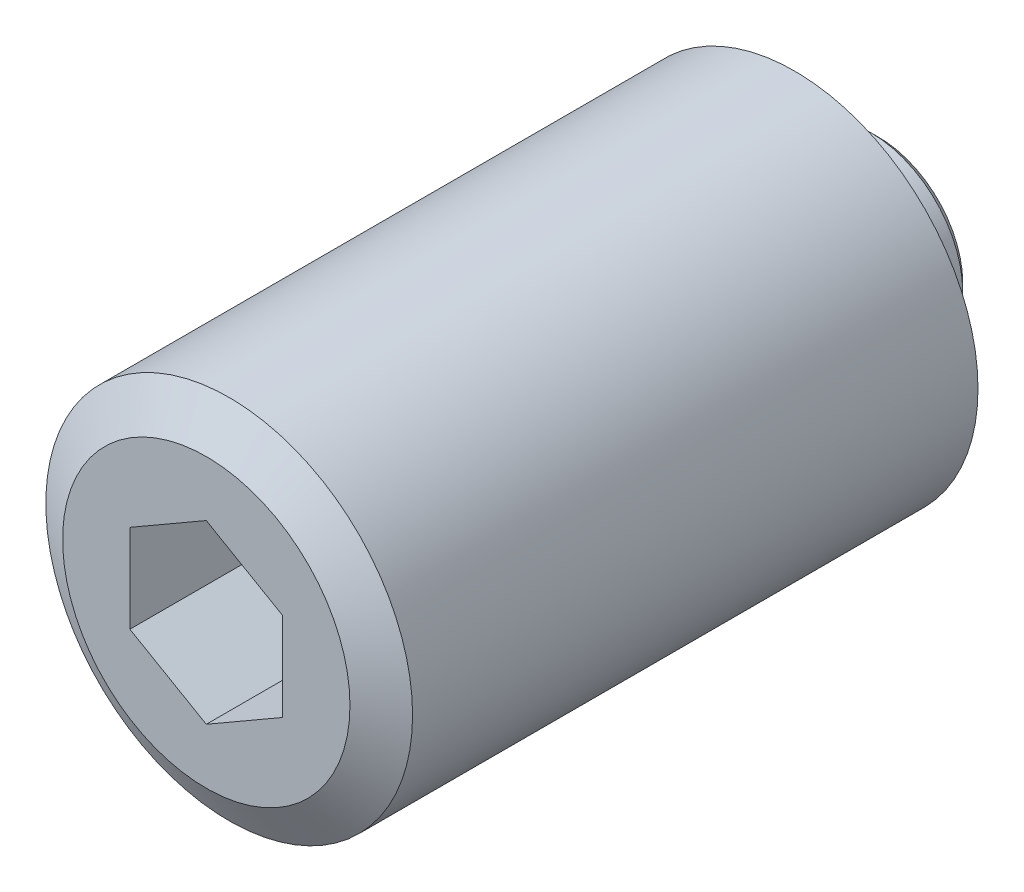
ISO-10303-21;
HEADER;
FILE_DESCRIPTION(('STEP AP214'),'2;1');
FILE_NAME('part.step','',(''),(''),'','','');
FILE_SCHEMA(('AUTOMOTIVE_DESIGN { 1 0 10303 214 1 1 1 1 }'));
ENDSEC;
DATA;
#1=APPLICATION_CONTEXT('core data for automotive mechanical design processes');
#2=APPLICATION_PROTOCOL_DEFINITION('international standard','automotive_design',2000,#1);
#3=PRODUCT_CONTEXT('',#1,'mechanical');
#4=PRODUCT('Part','Part','',(#3));
#5=PRODUCT_RELATED_PRODUCT_CATEGORY('part','',(#4));
#6=PRODUCT_DEFINITION_FORMATION('','',#4);
#7=PRODUCT_DEFINITION_CONTEXT('part definition',#1,'design');
#8=PRODUCT_DEFINITION('design','',#6,#7);
#9=PRODUCT_DEFINITION_SHAPE('','',#8);
#10=(LENGTH_UNIT() NAMED_UNIT(*) SI_UNIT(.MILLI.,.METRE.));
#11=(NAMED_UNIT(*) PLANE_ANGLE_UNIT() SI_UNIT($,.RADIAN.));
#12=(NAMED_UNIT(*) SI_UNIT($,.STERADIAN.) SOLID_ANGLE_UNIT());
#13=UNCERTAINTY_MEASURE_WITH_UNIT(LENGTH_MEASURE(1.E-05),#10,'distance_accuracy_value','');
#14=(GEOMETRIC_REPRESENTATION_CONTEXT(3) GLOBAL_UNCERTAINTY_ASSIGNED_CONTEXT((#13)) GLOBAL_UNIT_ASSIGNED_CONTEXT((#10,
#11,#12)) REPRESENTATION_CONTEXT('',''));
#15=CARTESIAN_POINT('',(0.,0.,0.));
#16=DIRECTION('',(0.,0.,1.));
#17=DIRECTION('',(1.,0.,0.));
#18=AXIS2_PLACEMENT_3D('',#15,#16,#17);
#19=CARTESIAN_POINT('',(0.,0.,0.));
#20=DIRECTION('',(0.,0.,1.));
#21=DIRECTION('',(1.,0.,0.));
#22=AXIS2_PLACEMENT_3D('',#19,#20,#21);
#23=PLANE('',#22);
#24=CARTESIAN_POINT('',(0.,0.,0.));
#25=DIRECTION('',(0.,0.,1.));
#26=DIRECTION('',(1.,0.,0.));
#27=AXIS2_PLACEMENT_3D('',#24,#25,#26);
#28=CIRCLE('',#27,5.5);
#29=CARTESIAN_POINT('',(5.5,0.,0.));
#30=VERTEX_POINT('',#29);
#31=EDGE_CURVE('E9',#30,#30,#28,.T.);
#32=ORIENTED_EDGE('',*,*,#31,.F.);
#33=EDGE_LOOP('',(#32));
#34=FACE_BOUND('',#33,.T.);
#35=ADVANCED_FACE('F14',(#34),#23,.F.);
#36=CARTESIAN_POINT('',(0.,0.,0.));
#37=DIRECTION('',(0.,0.,1.));
#38=DIRECTION('',(1.,0.,0.));
#39=AXIS2_PLACEMENT_3D('',#36,#37,#38);
#40=CONICAL_SURFACE('',#39,5.5,0.785398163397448);
#41=CARTESIAN_POINT('',(0.,0.,0.5));
#42=DIRECTION('',(0.,0.,1.));
#43=DIRECTION('',(1.,0.,0.));
#44=AXIS2_PLACEMENT_3D('',#41,#42,#43);
#45=CIRCLE('',#44,6.);
#46=CARTESIAN_POINT('',(6.,0.,0.5));
#47=VERTEX_POINT('',#46);
#48=EDGE_CURVE('E21',#47,#47,#45,.T.);
#49=ORIENTED_EDGE('',*,*,#48,.F.);
#50=EDGE_LOOP('',(#49));
#51=FACE_BOUND('',#50,.T.);
#52=ORIENTED_EDGE('',*,*,#31,.T.);
#53=EDGE_LOOP('',(#52));
#54=FACE_BOUND('',#53,.T.);
#55=ADVANCED_FACE('F145',(#51,#54),#40,.T.);
#56=CARTESIAN_POINT('',(0.,0.,48.0000000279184));
#57=DIRECTION('',(0.,0.,1.));
#58=DIRECTION('',(1.,0.,0.));
#59=AXIS2_PLACEMENT_3D('',#56,#57,#58);
#60=CYLINDRICAL_SURFACE('',#59,6.);
#61=CARTESIAN_POINT('',(0.,0.,2.6));
#62=DIRECTION('',(0.,0.,1.));
#63=DIRECTION('',(1.,0.,0.));
#64=AXIS2_PLACEMENT_3D('',#61,#62,#63);
#65=CIRCLE('',#64,6.);
#66=CARTESIAN_POINT('',(6.,0.,2.6));
#67=VERTEX_POINT('',#66);
#68=EDGE_CURVE('E138',#67,#67,#65,.T.);
#69=ORIENTED_EDGE('',*,*,#68,.F.);
#70=EDGE_LOOP('',(#69));
#71=FACE_BOUND('',#70,.T.);
#72=ORIENTED_EDGE('',*,*,#48,.T.);
#73=EDGE_LOOP('',(#72));
#74=FACE_BOUND('',#73,.T.);
#75=ADVANCED_FACE('F143',(#71,#74),#60,.T.);
#76=CARTESIAN_POINT('',(0.,6.21369453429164,2.6));
#77=DIRECTION('',(0.,0.,1.));
#78=DIRECTION('',(1.,0.,0.));
#79=AXIS2_PLACEMENT_3D('',#76,#77,#78);
#80=PLANE('',#79);
#81=CARTESIAN_POINT('',(0.,0.,2.6));
#82=DIRECTION('',(0.,0.,1.));
#83=DIRECTION('',(1.,0.,0.));
#84=AXIS2_PLACEMENT_3D('',#81,#82,#83);
#85=CIRCLE('',#84,6.21369453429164);
#86=CARTESIAN_POINT('',(0.,6.21369453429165,2.6));
#87=VERTEX_POINT('',#86);
#88=EDGE_CURVE('E135',#87,#87,#85,.T.);
#89=ORIENTED_EDGE('',*,*,#88,.F.);
#90=EDGE_LOOP('',(#89));
#91=FACE_BOUND('',#90,.T.);
#92=ORIENTED_EDGE('',*,*,#68,.T.);
#93=EDGE_LOOP('',(#92));
#94=FACE_BOUND('',#93,.T.);
#95=ADVANCED_FACE('F170',(#91,#94),#80,.F.);
#96=CARTESIAN_POINT('',(0.,-1.53354676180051E-07,6.79999989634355));
#97=DIRECTION('',(0.,0.,1.));
#98=DIRECTION('',(0.,1.,0.));
#99=AXIS2_PLACEMENT_3D('',#96,#97,#98);
#100=SPHERICAL_SURFACE('',#99,7.50000005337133);
#101=CARTESIAN_POINT('',(0.,0.,3.99999988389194));
#102=DIRECTION('',(0.,0.,1.));
#103=DIRECTION('',(1.,0.,0.));
#104=AXIS2_PLACEMENT_3D('',#101,#102,#103);
#105=CIRCLE('',#104,6.95772941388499);
#106=CARTESIAN_POINT('',(0.,6.95772941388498,3.99999988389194));
#107=VERTEX_POINT('',#106);
#108=EDGE_CURVE('E132',#107,#107,#105,.T.);
#109=CARTESIAN_POINT('',(0.,6.95772941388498,3.99999988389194));
#110=CARTESIAN_POINT('',(0.,6.95155231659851,3.98465039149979));
#111=CARTESIAN_POINT('',(0.,6.94532442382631,3.9693213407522));
#112=CARTESIAN_POINT('',(0.,6.93276732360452,3.93870479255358));
#113=CARTESIAN_POINT('',(0.,6.92643811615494,3.92341729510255));
#114=CARTESIAN_POINT('',(0.,6.91367866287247,3.89288452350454));
#115=CARTESIAN_POINT('',(0.,6.90724841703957,3.87763924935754));
#116=CARTESIAN_POINT('',(0.,6.89428716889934,3.8471915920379));
#117=CARTESIAN_POINT('',(0.,6.88775616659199,3.83198920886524));
#118=CARTESIAN_POINT('',(0.,6.87459369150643,3.80162799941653));
#119=CARTESIAN_POINT('',(0.,6.86796221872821,3.78646917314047));
#120=CARTESIAN_POINT('',(0.,6.85459909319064,3.75619574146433));
#121=CARTESIAN_POINT('',(0.,6.84786744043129,3.74108113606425));
#122=CARTESIAN_POINT('',(0.,6.83430424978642,3.71089680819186));
#123=CARTESIAN_POINT('',(0.,6.82747271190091,3.69582708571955));
#124=CARTESIAN_POINT('',(0.,6.81371005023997,3.66573318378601));
#125=CARTESIAN_POINT('',(0.,6.80677892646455,3.65070900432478));
#126=CARTESIAN_POINT('',(0.,6.79281739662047,3.62070684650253));
#127=CARTESIAN_POINT('',(0.,6.78578699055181,3.60572886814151));
#128=CARTESIAN_POINT('',(0.,6.77162720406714,3.57581976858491));
#129=CARTESIAN_POINT('',(0.,6.76449782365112,3.56088864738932));
#130=CARTESIAN_POINT('',(0.,6.75014040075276,3.53107391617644));
#131=CARTESIAN_POINT('',(0.,6.74291235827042,3.51619030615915));
#132=CARTESIAN_POINT('',(0.,6.72835792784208,3.4864712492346));
#133=CARTESIAN_POINT('',(0.,6.72103153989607,3.47163580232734));
#134=CARTESIAN_POINT('',(0.,6.70628073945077,3.44201372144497));
#135=CARTESIAN_POINT('',(0.,6.69885632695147,3.42722708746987));
#136=CARTESIAN_POINT('',(0.,6.68390980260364,3.39770328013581));
#137=CARTESIAN_POINT('',(0.,6.67638769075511,3.38296610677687));
#138=CARTESIAN_POINT('',(0.,6.66124609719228,3.35354186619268));
#139=CARTESIAN_POINT('',(0.,6.65362661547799,3.33885479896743));
#140=CARTESIAN_POINT('',(0.,6.6382906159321,3.30953141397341));
#141=CARTESIAN_POINT('',(0.,6.63057409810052,3.29489509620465));
#142=CARTESIAN_POINT('',(0.,6.6150443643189,3.26567385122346));
#143=CARTESIAN_POINT('',(0.,6.60723114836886,3.25108892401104));
#144=CARTESIAN_POINT('',(0.,6.59150836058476,3.2219710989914));
#145=CARTESIAN_POINT('',(0.,6.5835987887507,3.20743820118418));
#146=CARTESIAN_POINT('',(0.,6.56768363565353,3.17842507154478));
#147=CARTESIAN_POINT('',(0.,6.55967805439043,3.16394483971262));
#148=CARTESIAN_POINT('',(0.,6.54357123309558,3.13503767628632));
#149=CARTESIAN_POINT('',(0.,6.53546999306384,3.1206107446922));
#150=CARTESIAN_POINT('',(0.,6.51917220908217,3.09181081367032));
#151=CARTESIAN_POINT('',(0.,6.51097566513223,3.07743781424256));
#152=CARTESIAN_POINT('',(0.,6.49448763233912,3.04874637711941));
#153=CARTESIAN_POINT('',(0.,6.48619614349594,3.03442793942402));
#154=CARTESIAN_POINT('',(0.,6.46951858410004,3.00584625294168));
#155=CARTESIAN_POINT('',(0.,6.46113251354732,2.99158300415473));
#156=CARTESIAN_POINT('',(0.,6.44426615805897,2.96311232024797));
#157=CARTESIAN_POINT('',(0.,6.43578587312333,2.94890488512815));
#158=CARTESIAN_POINT('',(0.,6.41873146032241,2.92054645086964));
#159=CARTESIAN_POINT('',(0.,6.41015733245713,2.90639545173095));
#160=CARTESIAN_POINT('',(0.,6.39291560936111,2.87815050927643));
#161=CARTESIAN_POINT('',(0.,6.38424801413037,2.86405656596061));
#162=CARTESIAN_POINT('',(0.,6.3668197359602,2.83592635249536));
#163=CARTESIAN_POINT('',(0.,6.35805905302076,2.82189008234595));
#164=CARTESIAN_POINT('',(0.,6.34044498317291,2.79387583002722));
#165=CARTESIAN_POINT('',(0.,6.33159159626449,2.7798978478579));
#166=CARTESIAN_POINT('',(0.,6.3137925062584,2.75200078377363));
#167=CARTESIAN_POINT('',(0.,6.30484680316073,2.73808170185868));
#168=CARTESIAN_POINT('',(0.,6.28686347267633,2.71030304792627));
#169=CARTESIAN_POINT('',(0.,6.27782584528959,2.69644347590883));
#170=CARTESIAN_POINT('',(0.,6.25965906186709,2.6687844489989));
#171=CARTESIAN_POINT('',(0.,6.25052990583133,2.65498499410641));
#172=CARTESIAN_POINT('',(0.,6.23218046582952,2.62744680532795));
#173=CARTESIAN_POINT('',(0.,6.22296018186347,2.61370807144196));
#174=CARTESIAN_POINT('',(0.,6.21369453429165,2.6));
#175=B_SPLINE_CURVE_WITH_KNOTS('',3,(#109,#110,#111,#112,#113,#114,#115,#116,#117,#118,#119,
#120,#121,#122,#123,#124,#125,#126,#127,#128,#129,#130,#131,#132,#133,#134,#135,#136,#137,#138,
#139,#140,#141,#142,#143,#144,#145,#146,#147,#148,#149,#150,#151,#152,#153,#154,#155,#156,#157,
#158,#159,#160,#161,#162,#163,#164,#165,#166,#167,#168,#169,#170,#171,#172,#173,#174),
.UNSPECIFIED.,.F.,.F.,(4,2,2,2,2,2,2,2,2,2,2,2,2,2,2,2,2,2,2,2,2,2,2,2,2,2,2,2,2,2,2,2,4),(0.,
0.049637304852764,0.0992746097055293,0.148911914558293,0.198549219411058,0.248186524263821,
0.297823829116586,0.34746113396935,0.397098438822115,0.446735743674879,0.496373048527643,
0.546010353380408,0.595647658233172,0.645284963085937,0.6949222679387,0.744559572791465,
0.794196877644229,0.843834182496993,0.893471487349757,0.943108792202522,0.992746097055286,
1.04238340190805,1.09202070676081,1.14165801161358,1.19129531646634,1.24093262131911,
1.29056992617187,1.34020723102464,1.3898445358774,1.43948184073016,1.48911914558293,
1.53875645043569,1.58839375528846),.UNSPECIFIED.);
#176=EDGE_CURVE('BSEAM179',#107,#87,#175,.T.);
#177=ORIENTED_EDGE('',*,*,#108,.F.);
#178=ORIENTED_EDGE('',*,*,#88,.T.);
#179=ORIENTED_EDGE('',*,*,#176,.T.);
#180=ORIENTED_EDGE('',*,*,#176,.F.);
#181=EDGE_LOOP('',(#177,#179,#178,#180));
#182=FACE_BOUND('',#181,.T.);
#183=ADVANCED_FACE('F179',(#182),#100,.T.);
#184=CARTESIAN_POINT('',(0.,9.401924,3.99999995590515));
#185=DIRECTION('',(0.,0.,1.));
#186=DIRECTION('',(1.,0.,0.));
#187=AXIS2_PLACEMENT_3D('',#184,#185,#186);
#188=PLANE('',#187);
#189=CARTESIAN_POINT('',(0.,0.,4.00000002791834));
#190=DIRECTION('',(0.,0.,1.));
#191=DIRECTION('',(1.,0.,0.));
#192=AXIS2_PLACEMENT_3D('',#189,#190,#191);
#193=CIRCLE('',#192,9.401924);
#194=CARTESIAN_POINT('',(9.401924,0.,4.00000002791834));
#195=VERTEX_POINT('',#194);
#196=EDGE_CURVE('E129',#195,#195,#193,.T.);
#197=ORIENTED_EDGE('',*,*,#196,.F.);
#198=EDGE_LOOP('',(#197));
#199=FACE_BOUND('',#198,.T.);
#200=ORIENTED_EDGE('',*,*,#108,.T.);
#201=EDGE_LOOP('',(#200));
#202=FACE_BOUND('',#201,.T.);
#203=ADVANCED_FACE('F188',(#199,#202),#188,.F.);
#204=CARTESIAN_POINT('',(0.,0.,4.00000002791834));
#205=DIRECTION('',(0.,0.,1.));
#206=DIRECTION('',(1.,0.,0.));
#207=AXIS2_PLACEMENT_3D('',#204,#205,#206);
#208=CONICAL_SURFACE('',#207,9.401924,1.04719751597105);
#209=CARTESIAN_POINT('',(0.,0.,5.50000002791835));
#210=DIRECTION('',(0.,0.,1.));
#211=DIRECTION('',(1.,0.,0.));
#212=AXIS2_PLACEMENT_3D('',#209,#210,#211);
#213=CIRCLE('',#212,12.);
#214=CARTESIAN_POINT('',(12.,0.,5.50000002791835));
#215=VERTEX_POINT('',#214);
#216=EDGE_CURVE('E126',#215,#215,#213,.T.);
#217=ORIENTED_EDGE('',*,*,#216,.F.);
#218=EDGE_LOOP('',(#217));
#219=FACE_BOUND('',#218,.T.);
#220=ORIENTED_EDGE('',*,*,#196,.T.);
#221=EDGE_LOOP('',(#220));
#222=FACE_BOUND('',#221,.T.);
#223=ADVANCED_FACE('F197',(#219,#222),#208,.T.);
#224=CARTESIAN_POINT('',(0.,0.,48.0000000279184));
#225=DIRECTION('',(0.,0.,1.));
#226=DIRECTION('',(1.,0.,0.));
#227=AXIS2_PLACEMENT_3D('',#224,#225,#226);
#228=CYLINDRICAL_SURFACE('',#227,12.);
#229=CARTESIAN_POINT('',(0.,0.,42.5000000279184));
#230=DIRECTION('',(0.,0.,1.));
#231=DIRECTION('',(1.,0.,0.));
#232=AXIS2_PLACEMENT_3D('',#229,#230,#231);
#233=CIRCLE('',#232,12.);
#234=CARTESIAN_POINT('',(12.,0.,42.5000000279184));
#235=VERTEX_POINT('',#234);
#236=EDGE_CURVE('E123',#235,#235,#233,.T.);
#237=ORIENTED_EDGE('',*,*,#236,.F.);
#238=EDGE_LOOP('',(#237));
#239=FACE_BOUND('',#238,.T.);
#240=ORIENTED_EDGE('',*,*,#216,.T.);
#241=EDGE_LOOP('',(#240));
#242=FACE_BOUND('',#241,.T.);
#243=ADVANCED_FACE('F206',(#239,#242),#228,.T.);
#244=CARTESIAN_POINT('',(0.,0.,42.5000000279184));
#245=DIRECTION('',(0.,0.,-1.));
#246=DIRECTION('',(-1.,0.,0.));
#247=AXIS2_PLACEMENT_3D('',#244,#245,#246);
#248=CONICAL_SURFACE('',#247,12.,1.04719751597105);
#249=CARTESIAN_POINT('',(0.,0.,44.0000000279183));
#250=DIRECTION('',(0.,0.,1.));
#251=DIRECTION('',(1.,0.,0.));
#252=AXIS2_PLACEMENT_3D('',#249,#250,#251);
#253=CIRCLE('',#252,9.401924);
#254=CARTESIAN_POINT('',(9.401924,0.,44.0000000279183));
#255=VERTEX_POINT('',#254);
#256=EDGE_CURVE('E115',#255,#255,#253,.T.);
#257=ORIENTED_EDGE('',*,*,#256,.F.);
#258=EDGE_LOOP('',(#257));
#259=FACE_BOUND('',#258,.T.);
#260=ORIENTED_EDGE('',*,*,#236,.T.);
#261=EDGE_LOOP('',(#260));
#262=FACE_BOUND('',#261,.T.);
#263=ADVANCED_FACE('F215',(#259,#262),#248,.T.);
#264=CARTESIAN_POINT('',(0.,9.401924,44.0000000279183));
#265=DIRECTION('',(0.,0.,-1.));
#266=DIRECTION('',(-1.,0.,0.));
#267=AXIS2_PLACEMENT_3D('',#264,#265,#266);
#268=PLANE('',#267);
#269=DIRECTION('',(-0.866025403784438,-0.5,0.));
#270=VECTOR('',#269,1.);
#271=CARTESIAN_POINT('',(0.,5.77350269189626,44.0000000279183));
#272=LINE('',#271,#270);
#273=CARTESIAN_POINT('',(0.,5.77350269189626,44.0000000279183));
#274=VERTEX_POINT('',#273);
#275=CARTESIAN_POINT('',(-5.,2.88675134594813,44.0000000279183));
#276=VERTEX_POINT('',#275);
#277=EDGE_CURVE('E102',#274,#276,#272,.T.);
#278=ORIENTED_EDGE('',*,*,#277,.F.);
#279=DIRECTION('',(-0.866025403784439,0.5,0.));
#280=VECTOR('',#279,1.);
#281=CARTESIAN_POINT('',(5.,2.88675134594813,44.0000000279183));
#282=LINE('',#281,#280);
#283=CARTESIAN_POINT('',(5.,2.88675134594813,44.0000000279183));
#284=VERTEX_POINT('',#283);
#285=EDGE_CURVE('E28',#284,#274,#282,.T.);
#286=ORIENTED_EDGE('',*,*,#285,.F.);
#287=DIRECTION('',(0.,1.,0.));
#288=VECTOR('',#287,1.);
#289=CARTESIAN_POINT('',(5.,-2.88675134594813,44.0000000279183));
#290=LINE('',#289,#288);
#291=CARTESIAN_POINT('',(5.,-2.88675134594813,44.0000000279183));
#292=VERTEX_POINT('',#291);
#293=EDGE_CURVE('E111',#292,#284,#290,.T.);
#294=ORIENTED_EDGE('',*,*,#293,.F.);
#295=DIRECTION('',(0.866025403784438,0.5,0.));
#296=VECTOR('',#295,1.);
#297=CARTESIAN_POINT('',(0.,-5.77350269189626,44.0000000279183));
#298=LINE('',#297,#296);
#299=CARTESIAN_POINT('',(0.,-5.77350269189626,44.0000000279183));
#300=VERTEX_POINT('',#299);
#301=EDGE_CURVE('E109',#300,#292,#298,.T.);
#302=ORIENTED_EDGE('',*,*,#301,.F.);
#303=DIRECTION('',(0.866025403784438,-0.5,0.));
#304=VECTOR('',#303,1.);
#305=CARTESIAN_POINT('',(-5.,-2.88675134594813,44.0000000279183));
#306=LINE('',#305,#304);
#307=CARTESIAN_POINT('',(-5.,-2.88675134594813,44.0000000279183));
#308=VERTEX_POINT('',#307);
#309=EDGE_CURVE('E76',#308,#300,#306,.T.);
#310=ORIENTED_EDGE('',*,*,#309,.F.);
#311=DIRECTION('',(0.,-1.,0.));
#312=VECTOR('',#311,1.);
#313=CARTESIAN_POINT('',(-5.,2.88675134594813,44.0000000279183));
#314=LINE('',#313,#312);
#315=EDGE_CURVE('E105',#276,#308,#314,.T.);
#316=ORIENTED_EDGE('',*,*,#315,.F.);
#317=EDGE_LOOP('',(#278,#286,#294,#302,#310,#316));
#318=FACE_BOUND('',#317,.T.);
#319=ORIENTED_EDGE('',*,*,#256,.T.);
#320=EDGE_LOOP('',(#319));
#321=FACE_BOUND('',#320,.T.);
#322=ADVANCED_FACE('F224',(#318,#321),#268,.F.);
#323=CARTESIAN_POINT('',(5.,2.88675134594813,36.0000000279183));
#324=DIRECTION('',(0.5,0.866025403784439,0.));
#325=DIRECTION('',(-0.866025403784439,0.5,0.));
#326=AXIS2_PLACEMENT_3D('',#323,#324,#325);
#327=PLANE('',#326);
#328=ORIENTED_EDGE('',*,*,#285,.T.);
#329=DIRECTION('',(0.,0.,1.));
#330=VECTOR('',#329,1.);
#331=CARTESIAN_POINT('',(0.,5.77350269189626,36.0000000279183));
#332=LINE('',#331,#330);
#333=CARTESIAN_POINT('',(0.,5.77350269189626,36.0000000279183));
#334=VERTEX_POINT('',#333);
#335=EDGE_CURVE('E58',#334,#274,#332,.T.);
#336=ORIENTED_EDGE('',*,*,#335,.F.);
#337=DIRECTION('',(-0.866025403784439,0.5,0.));
#338=VECTOR('',#337,1.);
#339=CARTESIAN_POINT('',(5.,2.88675134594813,36.0000000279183));
#340=LINE('',#339,#338);
#341=CARTESIAN_POINT('',(5.,2.88675134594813,36.0000000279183));
#342=VERTEX_POINT('',#341);
#343=EDGE_CURVE('E113',#342,#334,#340,.T.);
#344=ORIENTED_EDGE('',*,*,#343,.F.);
#345=DIRECTION('',(0.,0.,1.));
#346=VECTOR('',#345,1.);
#347=CARTESIAN_POINT('',(5.,2.88675134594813,36.0000000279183));
#348=LINE('',#347,#346);
#349=EDGE_CURVE('E36',#342,#284,#348,.T.);
#350=ORIENTED_EDGE('',*,*,#349,.T.);
#351=EDGE_LOOP('',(#328,#336,#344,#350));
#352=FACE_BOUND('',#351,.T.);
#353=ADVANCED_FACE('F233',(#352),#327,.F.);
#354=CARTESIAN_POINT('',(5.,-2.88675134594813,36.0000000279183));
#355=DIRECTION('',(1.,0.,0.));
#356=DIRECTION('',(0.,0.,-1.));
#357=AXIS2_PLACEMENT_3D('',#354,#355,#356);
#358=PLANE('',#357);
#359=ORIENTED_EDGE('',*,*,#293,.T.);
#360=ORIENTED_EDGE('',*,*,#349,.F.);
#361=DIRECTION('',(0.,1.,0.));
#362=VECTOR('',#361,1.);
#363=CARTESIAN_POINT('',(5.,-2.88675134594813,36.0000000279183));
#364=LINE('',#363,#362);
#365=CARTESIAN_POINT('',(5.,-2.88675134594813,36.0000000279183));
#366=VERTEX_POINT('',#365);
#367=EDGE_CURVE('E88',#366,#342,#364,.T.);
#368=ORIENTED_EDGE('',*,*,#367,.F.);
#369=DIRECTION('',(0.,0.,1.));
#370=VECTOR('',#369,1.);
#371=CARTESIAN_POINT('',(5.,-2.88675134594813,36.0000000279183));
#372=LINE('',#371,#370);
#373=EDGE_CURVE('E80',#366,#292,#372,.T.);
#374=ORIENTED_EDGE('',*,*,#373,.T.);
#375=EDGE_LOOP('',(#359,#360,#368,#374));
#376=FACE_BOUND('',#375,.T.);
#377=ADVANCED_FACE('F242',(#376),#358,.F.);
#378=CARTESIAN_POINT('',(0.,-5.77350269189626,36.0000000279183));
#379=DIRECTION('',(0.5,-0.866025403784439,0.));
#380=DIRECTION('',(0.866025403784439,0.5,0.));
#381=AXIS2_PLACEMENT_3D('',#378,#379,#380);
#382=PLANE('',#381);
#383=ORIENTED_EDGE('',*,*,#301,.T.);
#384=ORIENTED_EDGE('',*,*,#373,.F.);
#385=DIRECTION('',(0.866025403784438,0.5,0.));
#386=VECTOR('',#385,1.);
#387=CARTESIAN_POINT('',(0.,-5.77350269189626,36.0000000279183));
#388=LINE('',#387,#386);
#389=CARTESIAN_POINT('',(0.,-5.77350269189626,36.0000000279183));
#390=VERTEX_POINT('',#389);
#391=EDGE_CURVE('E84',#390,#366,#388,.T.);
#392=ORIENTED_EDGE('',*,*,#391,.F.);
#393=DIRECTION('',(0.,0.,1.));
#394=VECTOR('',#393,1.);
#395=CARTESIAN_POINT('',(0.,-5.77350269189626,36.0000000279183));
#396=LINE('',#395,#394);
#397=EDGE_CURVE('E69',#390,#300,#396,.T.);
#398=ORIENTED_EDGE('',*,*,#397,.T.);
#399=EDGE_LOOP('',(#383,#384,#392,#398));
#400=FACE_BOUND('',#399,.T.);
#401=ADVANCED_FACE('F85',(#400),#382,.F.);
#402=CARTESIAN_POINT('',(-5.,-2.88675134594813,36.0000000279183));
#403=DIRECTION('',(-0.5,-0.866025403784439,0.));
#404=DIRECTION('',(0.866025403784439,-0.5,0.));
#405=AXIS2_PLACEMENT_3D('',#402,#403,#404);
#406=PLANE('',#405);
#407=ORIENTED_EDGE('',*,*,#309,.T.);
#408=ORIENTED_EDGE('',*,*,#397,.F.);
#409=DIRECTION('',(0.866025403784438,-0.5,0.));
#410=VECTOR('',#409,1.);
#411=CARTESIAN_POINT('',(-5.,-2.88675134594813,36.0000000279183));
#412=LINE('',#411,#410);
#413=CARTESIAN_POINT('',(-5.,-2.88675134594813,36.0000000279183));
#414=VERTEX_POINT('',#413);
#415=EDGE_CURVE('E73',#414,#390,#412,.T.);
#416=ORIENTED_EDGE('',*,*,#415,.F.);
#417=DIRECTION('',(0.,0.,1.));
#418=VECTOR('',#417,1.);
#419=CARTESIAN_POINT('',(-5.,-2.88675134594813,36.0000000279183));
#420=LINE('',#419,#418);
#421=EDGE_CURVE('E81',#414,#308,#420,.T.);
#422=ORIENTED_EDGE('',*,*,#421,.T.);
#423=EDGE_LOOP('',(#407,#408,#416,#422));
#424=FACE_BOUND('',#423,.T.);
#425=ADVANCED_FACE('F71',(#424),#406,.F.);
#426=CARTESIAN_POINT('',(-5.,2.88675134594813,36.0000000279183));
#427=DIRECTION('',(-1.,0.,0.));
#428=DIRECTION('',(0.,0.,1.));
#429=AXIS2_PLACEMENT_3D('',#426,#427,#428);
#430=PLANE('',#429);
#431=ORIENTED_EDGE('',*,*,#315,.T.);
#432=ORIENTED_EDGE('',*,*,#421,.F.);
#433=DIRECTION('',(0.,-1.,0.));
#434=VECTOR('',#433,1.);
#435=CARTESIAN_POINT('',(-5.,2.88675134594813,36.0000000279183));
#436=LINE('',#435,#434);
#437=CARTESIAN_POINT('',(-5.,2.88675134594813,36.0000000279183));
#438=VERTEX_POINT('',#437);
#439=EDGE_CURVE('E94',#438,#414,#436,.T.);
#440=ORIENTED_EDGE('',*,*,#439,.F.);
#441=DIRECTION('',(0.,0.,1.));
#442=VECTOR('',#441,1.);
#443=CARTESIAN_POINT('',(-5.,2.88675134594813,36.0000000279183));
#444=LINE('',#443,#442);
#445=EDGE_CURVE('E118',#438,#276,#444,.T.);
#446=ORIENTED_EDGE('',*,*,#445,.T.);
#447=EDGE_LOOP('',(#431,#432,#440,#446));
#448=FACE_BOUND('',#447,.T.);
#449=ADVANCED_FACE('F264',(#448),#430,.F.);
#450=CARTESIAN_POINT('',(0.,5.77350269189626,36.0000000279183));
#451=DIRECTION('',(-0.5,0.866025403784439,0.));
#452=DIRECTION('',(-0.866025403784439,-0.5,0.));
#453=AXIS2_PLACEMENT_3D('',#450,#451,#452);
#454=PLANE('',#453);
#455=ORIENTED_EDGE('',*,*,#277,.T.);
#456=ORIENTED_EDGE('',*,*,#445,.F.);
#457=DIRECTION('',(-0.866025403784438,-0.5,0.));
#458=VECTOR('',#457,1.);
#459=CARTESIAN_POINT('',(0.,5.77350269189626,36.0000000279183));
#460=LINE('',#459,#458);
#461=EDGE_CURVE('E96',#334,#438,#460,.T.);
#462=ORIENTED_EDGE('',*,*,#461,.F.);
#463=ORIENTED_EDGE('',*,*,#335,.T.);
#464=EDGE_LOOP('',(#455,#456,#462,#463));
#465=FACE_BOUND('',#464,.T.);
#466=ADVANCED_FACE('F272',(#465),#454,.F.);
#467=CARTESIAN_POINT('',(0.,5.77350269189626,36.0000000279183));
#468=DIRECTION('',(0.,0.,1.));
#469=DIRECTION('',(1.,0.,0.));
#470=AXIS2_PLACEMENT_3D('',#467,#468,#469);
#471=PLANE('',#470);
#472=ORIENTED_EDGE('',*,*,#343,.T.);
#473=ORIENTED_EDGE('',*,*,#461,.T.);
#474=ORIENTED_EDGE('',*,*,#439,.T.);
#475=ORIENTED_EDGE('',*,*,#415,.T.);
#476=ORIENTED_EDGE('',*,*,#391,.T.);
#477=ORIENTED_EDGE('',*,*,#367,.T.);
#478=EDGE_LOOP('',(#472,#473,#474,#475,#476,#477));
#479=FACE_BOUND('',#478,.T.);
#480=ADVANCED_FACE('F91',(#479),#471,.T.);
#481=CLOSED_SHELL('',(#35,#55,#75,#95,#183,#203,#223,#243,#263,#322,#353,#377,#401,#425,#449,
#466,#480));
#482=MANIFOLD_SOLID_BREP('B1',#481);
#483=ADVANCED_BREP_SHAPE_REPRESENTATION('',(#18,#482),#14);
#484=SHAPE_DEFINITION_REPRESENTATION(#9,#483);
ENDSEC;
END-ISO-10303-21;
